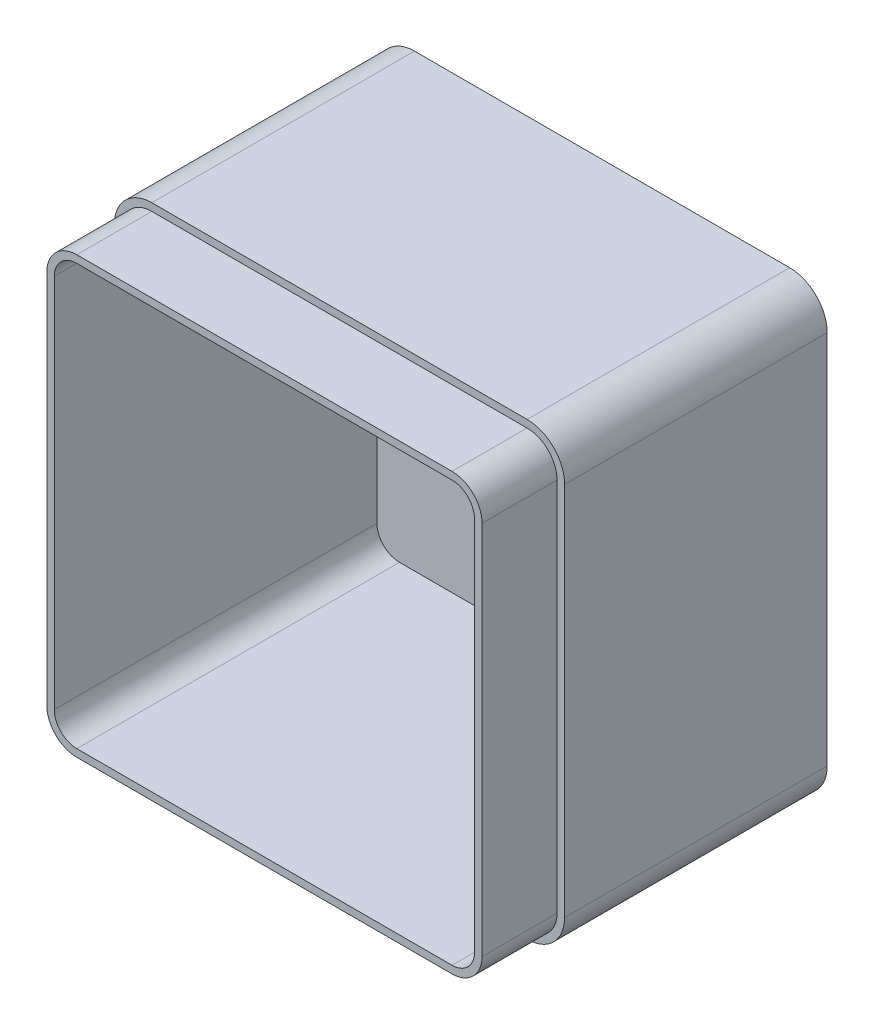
from build123d import *

# Parameters (mm, degrees)
SKETCH1_W           = 120
SKETCH1_H           = 120
BOSS_EXTRUDE3_DEPTH = 90
FILLET1_R           = 10
SHELL1_T            = -4
CUT_EXTRUDE1_DEPTH  = 20


with BuildPart() as part:
    # Sketch1 → Boss-Extrude3 (new body)
    with BuildSketch(Plane.XY):
        with Locations((60, 60)):
            Rectangle(SKETCH1_W, SKETCH1_H)
    extrude(amount=BOSS_EXTRUDE3_DEPTH)

    # Fillet1
    fillet1_edges = [part.edges().sort_by_distance(p)[0] for p in [
        (0, 120, 45),
        (120, 120, 45),
        (120, 0, 45),
        (0, 0, 45),
    ]]
    fillet(fillet1_edges, radius=FILLET1_R)

    # Shell1
    shell1_openings = [part.faces().sort_by_distance(p)[0] for p in [
        (60, 60, 90),
    ]]
    offset(amount=SHELL1_T, openings=shell1_openings, kind=Kind.INTERSECTION)

    # Sketch3 → Cut-Extrude1 (cut)
    with BuildSketch(Plane.XY.offset(90)):
        with BuildLine():
            Line((0, 110), (0, 10))
            ThreePointArc((0, 10), (2.928932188, 2.928932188), (10, 0))
            Line((10, 0), (110, 0))
            ThreePointArc((110, 0), (117.071067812, 2.928932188), (120, 10))
            Line((120, 10), (120, 110))
            ThreePointArc((120, 110), (117.071067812, 117.071067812), (110, 120))
            Line((110, 120), (10, 120))
            ThreePointArc((10, 120), (2.928932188, 117.071067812), (0, 110))
        make_face()
        with BuildLine():
            Line((2, 110), (2, 10))
            ThreePointArc((2, 10), (4.343145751, 4.343145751), (10, 2))
            Line((10, 2), (110, 2))
            ThreePointArc((110, 2), (115.656854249, 4.343145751), (118, 10))
            Line((118, 10), (118, 110))
            ThreePointArc((118, 110), (115.656854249, 115.656854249), (110, 118))
            Line((110, 118), (10, 118))
            ThreePointArc((10, 118), (4.343145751, 115.656854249), (2, 110))
        make_face(mode=Mode.SUBTRACT)
    extrude(amount=-CUT_EXTRUDE1_DEPTH, mode=Mode.SUBTRACT)


solid = part.part
